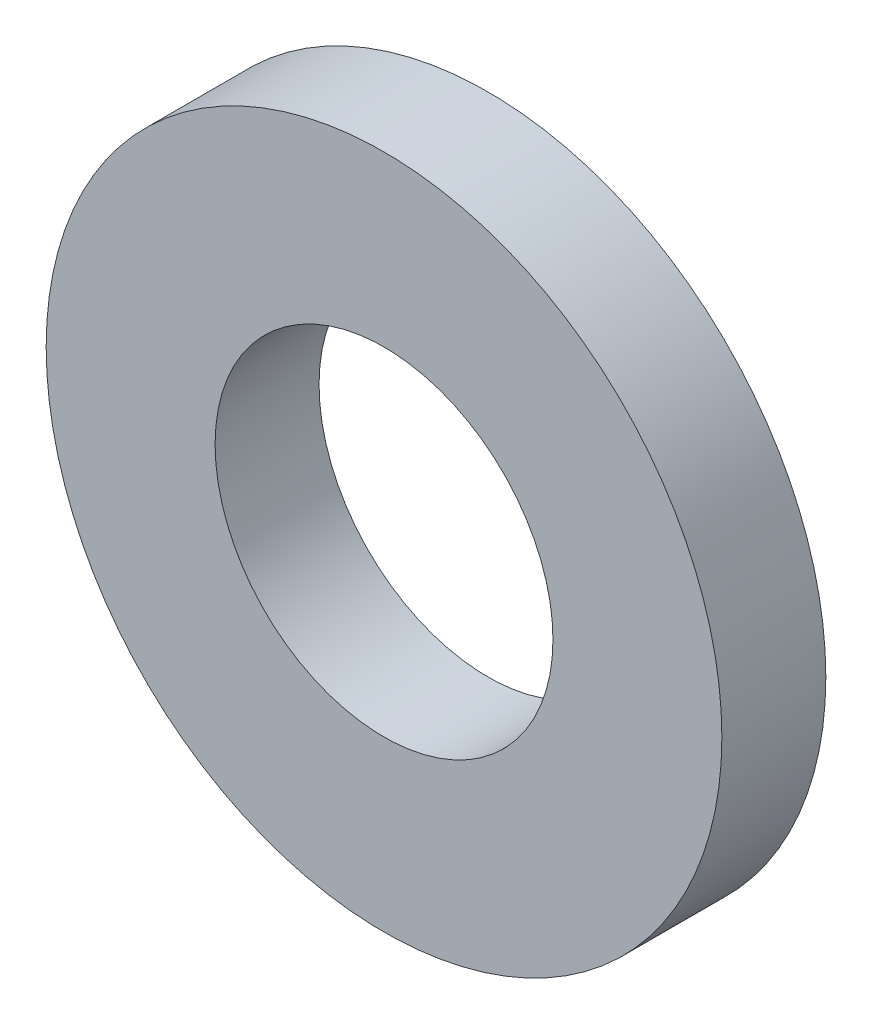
ISO-10303-21;
HEADER;
FILE_DESCRIPTION(('STEP AP214'),'2;1');
FILE_NAME('part.step','',(''),(''),'','','');
FILE_SCHEMA(('AUTOMOTIVE_DESIGN { 1 0 10303 214 1 1 1 1 }'));
ENDSEC;
DATA;
#1=APPLICATION_CONTEXT('core data for automotive mechanical design processes');
#2=APPLICATION_PROTOCOL_DEFINITION('international standard','automotive_design',2000,#1);
#3=PRODUCT_CONTEXT('',#1,'mechanical');
#4=PRODUCT('Part','Part','',(#3));
#5=PRODUCT_RELATED_PRODUCT_CATEGORY('part','',(#4));
#6=PRODUCT_DEFINITION_FORMATION('','',#4);
#7=PRODUCT_DEFINITION_CONTEXT('part definition',#1,'design');
#8=PRODUCT_DEFINITION('design','',#6,#7);
#9=PRODUCT_DEFINITION_SHAPE('','',#8);
#10=(LENGTH_UNIT() NAMED_UNIT(*) SI_UNIT(.MILLI.,.METRE.));
#11=(NAMED_UNIT(*) PLANE_ANGLE_UNIT() SI_UNIT($,.RADIAN.));
#12=(NAMED_UNIT(*) SI_UNIT($,.STERADIAN.) SOLID_ANGLE_UNIT());
#13=UNCERTAINTY_MEASURE_WITH_UNIT(LENGTH_MEASURE(1.E-05),#10,'distance_accuracy_value','');
#14=(GEOMETRIC_REPRESENTATION_CONTEXT(3) GLOBAL_UNCERTAINTY_ASSIGNED_CONTEXT((#13)) GLOBAL_UNIT_ASSIGNED_CONTEXT((#10,
#11,#12)) REPRESENTATION_CONTEXT('',''));
#15=CARTESIAN_POINT('',(0.,0.,0.));
#16=DIRECTION('',(0.,0.,1.));
#17=DIRECTION('',(1.,0.,0.));
#18=AXIS2_PLACEMENT_3D('',#15,#16,#17);
#19=CARTESIAN_POINT('',(0.,0.,2.));
#20=DIRECTION('',(0.,0.,1.));
#21=DIRECTION('',(1.,0.,0.));
#22=AXIS2_PLACEMENT_3D('',#19,#20,#21);
#23=PLANE('',#22);
#24=CARTESIAN_POINT('',(0.,0.,2.));
#25=DIRECTION('',(0.,0.,1.));
#26=DIRECTION('',(1.,0.,0.));
#27=AXIS2_PLACEMENT_3D('',#24,#25,#26);
#28=CIRCLE('',#27,6.5);
#29=CARTESIAN_POINT('',(6.5,0.,2.));
#30=VERTEX_POINT('',#29);
#31=EDGE_CURVE('E10',#30,#30,#28,.T.);
#32=ORIENTED_EDGE('',*,*,#31,.T.);
#33=EDGE_LOOP('',(#32));
#34=FACE_BOUND('',#33,.T.);
#35=CARTESIAN_POINT('',(0.,0.,2.));
#36=DIRECTION('',(0.,0.,1.));
#37=DIRECTION('',(1.,0.,0.));
#38=AXIS2_PLACEMENT_3D('',#35,#36,#37);
#39=CIRCLE('',#38,3.25);
#40=CARTESIAN_POINT('',(3.25,0.,2.));
#41=VERTEX_POINT('',#40);
#42=EDGE_CURVE('E41',#41,#41,#39,.T.);
#43=ORIENTED_EDGE('',*,*,#42,.F.);
#44=EDGE_LOOP('',(#43));
#45=FACE_BOUND('',#44,.T.);
#46=ADVANCED_FACE('F30',(#34,#45),#23,.T.);
#47=CARTESIAN_POINT('',(0.,0.,0.));
#48=DIRECTION('',(0.,0.,1.));
#49=DIRECTION('',(1.,0.,0.));
#50=AXIS2_PLACEMENT_3D('',#47,#48,#49);
#51=PLANE('',#50);
#52=CARTESIAN_POINT('',(0.,0.,0.));
#53=DIRECTION('',(0.,0.,1.));
#54=DIRECTION('',(1.,0.,0.));
#55=AXIS2_PLACEMENT_3D('',#52,#53,#54);
#56=CIRCLE('',#55,6.5);
#57=CARTESIAN_POINT('',(6.5,0.,0.));
#58=VERTEX_POINT('',#57);
#59=EDGE_CURVE('E37',#58,#58,#56,.T.);
#60=ORIENTED_EDGE('',*,*,#59,.F.);
#61=EDGE_LOOP('',(#60));
#62=FACE_BOUND('',#61,.T.);
#63=CARTESIAN_POINT('',(0.,0.,0.));
#64=DIRECTION('',(0.,0.,1.));
#65=DIRECTION('',(1.,0.,0.));
#66=AXIS2_PLACEMENT_3D('',#63,#64,#65);
#67=CIRCLE('',#66,3.25);
#68=CARTESIAN_POINT('',(3.25,0.,0.));
#69=VERTEX_POINT('',#68);
#70=EDGE_CURVE('E45',#69,#69,#67,.T.);
#71=ORIENTED_EDGE('',*,*,#70,.T.);
#72=EDGE_LOOP('',(#71));
#73=FACE_BOUND('',#72,.T.);
#74=ADVANCED_FACE('F51',(#62,#73),#51,.F.);
#75=CARTESIAN_POINT('',(0.,0.,2.));
#76=DIRECTION('',(0.,0.,-1.));
#77=DIRECTION('',(-1.,0.,0.));
#78=AXIS2_PLACEMENT_3D('',#75,#76,#77);
#79=CYLINDRICAL_SURFACE('',#78,6.5);
#80=ORIENTED_EDGE('',*,*,#31,.F.);
#81=EDGE_LOOP('',(#80));
#82=FACE_BOUND('',#81,.T.);
#83=ORIENTED_EDGE('',*,*,#59,.T.);
#84=EDGE_LOOP('',(#83));
#85=FACE_BOUND('',#84,.T.);
#86=ADVANCED_FACE('F32',(#82,#85),#79,.T.);
#87=CARTESIAN_POINT('',(0.,0.,2.));
#88=DIRECTION('',(0.,0.,-1.));
#89=DIRECTION('',(-1.,0.,0.));
#90=AXIS2_PLACEMENT_3D('',#87,#88,#89);
#91=CYLINDRICAL_SURFACE('',#90,3.25);
#92=ORIENTED_EDGE('',*,*,#42,.T.);
#93=EDGE_LOOP('',(#92));
#94=FACE_BOUND('',#93,.T.);
#95=ORIENTED_EDGE('',*,*,#70,.F.);
#96=EDGE_LOOP('',(#95));
#97=FACE_BOUND('',#96,.T.);
#98=ADVANCED_FACE('F53',(#94,#97),#91,.F.);
#99=CLOSED_SHELL('',(#46,#74,#86,#98));
#100=MANIFOLD_SOLID_BREP('B2',#99);
#101=ADVANCED_BREP_SHAPE_REPRESENTATION('',(#18,#100),#14);
#102=SHAPE_DEFINITION_REPRESENTATION(#9,#101);
ENDSEC;
END-ISO-10303-21;
